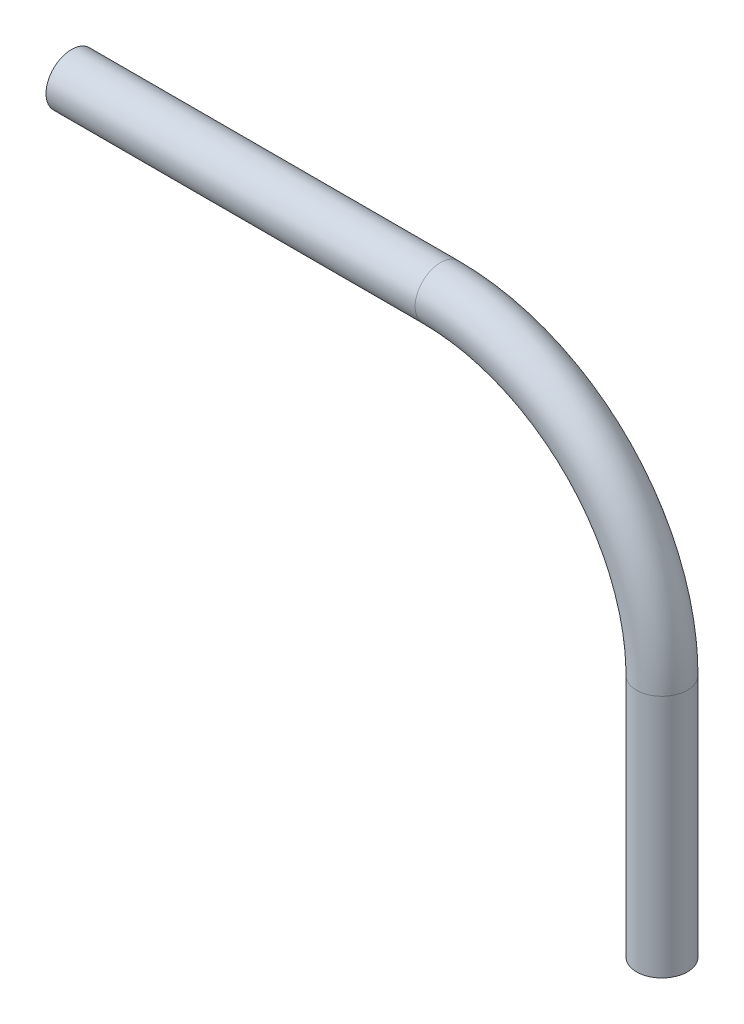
ISO-10303-21;
HEADER;
FILE_DESCRIPTION(('STEP AP214'),'2;1');
FILE_NAME('part.step','',(''),(''),'','','');
FILE_SCHEMA(('AUTOMOTIVE_DESIGN { 1 0 10303 214 1 1 1 1 }'));
ENDSEC;
DATA;
#1=APPLICATION_CONTEXT('core data for automotive mechanical design processes');
#2=APPLICATION_PROTOCOL_DEFINITION('international standard','automotive_design',2000,#1);
#3=PRODUCT_CONTEXT('',#1,'mechanical');
#4=PRODUCT('Part','Part','',(#3));
#5=PRODUCT_RELATED_PRODUCT_CATEGORY('part','',(#4));
#6=PRODUCT_DEFINITION_FORMATION('','',#4);
#7=PRODUCT_DEFINITION_CONTEXT('part definition',#1,'design');
#8=PRODUCT_DEFINITION('design','',#6,#7);
#9=PRODUCT_DEFINITION_SHAPE('','',#8);
#10=(LENGTH_UNIT() NAMED_UNIT(*) SI_UNIT(.MILLI.,.METRE.));
#11=(NAMED_UNIT(*) PLANE_ANGLE_UNIT() SI_UNIT($,.RADIAN.));
#12=(NAMED_UNIT(*) SI_UNIT($,.STERADIAN.) SOLID_ANGLE_UNIT());
#13=UNCERTAINTY_MEASURE_WITH_UNIT(LENGTH_MEASURE(1.E-05),#10,'distance_accuracy_value','');
#14=(GEOMETRIC_REPRESENTATION_CONTEXT(3) GLOBAL_UNCERTAINTY_ASSIGNED_CONTEXT((#13)) GLOBAL_UNIT_ASSIGNED_CONTEXT((#10,
#11,#12)) REPRESENTATION_CONTEXT('',''));
#15=CARTESIAN_POINT('',(0.,0.,0.));
#16=DIRECTION('',(0.,0.,1.));
#17=DIRECTION('',(1.,0.,0.));
#18=AXIS2_PLACEMENT_3D('',#15,#16,#17);
#19=CARTESIAN_POINT('',(6.10622663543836E-13,296.002867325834,0.));
#20=DIRECTION('',(0.,-1.,0.));
#21=DIRECTION('',(1.,0.,0.));
#22=AXIS2_PLACEMENT_3D('',#19,#20,#21);
#23=CYLINDRICAL_SURFACE('',#22,14.5);
#24=CARTESIAN_POINT('',(3.88578058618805E-13,296.002867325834,0.));
#25=DIRECTION('',(0.,-1.,0.));
#26=DIRECTION('',(1.,0.,0.));
#27=AXIS2_PLACEMENT_3D('',#24,#25,#26);
#28=CIRCLE('',#27,14.5);
#29=CARTESIAN_POINT('',(14.5000000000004,296.002867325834,0.));
#30=VERTEX_POINT('',#29);
#31=EDGE_CURVE('E38',#30,#30,#28,.F.);
#32=ORIENTED_EDGE('',*,*,#31,.T.);
#33=EDGE_LOOP('',(#32));
#34=FACE_BOUND('',#33,.T.);
#35=CARTESIAN_POINT('',(0.,130.749822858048,0.));
#36=DIRECTION('',(0.,-1.,0.));
#37=DIRECTION('',(1.,0.,0.));
#38=AXIS2_PLACEMENT_3D('',#35,#36,#37);
#39=CIRCLE('',#38,14.5);
#40=CARTESIAN_POINT('',(14.5,130.749822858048,0.));
#41=VERTEX_POINT('',#40);
#42=EDGE_CURVE('E18',#41,#41,#39,.F.);
#43=ORIENTED_EDGE('',*,*,#42,.F.);
#44=EDGE_LOOP('',(#43));
#45=FACE_BOUND('',#44,.T.);
#46=ADVANCED_FACE('F15',(#34,#45),#23,.F.);
#47=CARTESIAN_POINT('',(0.,130.749822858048,0.));
#48=DIRECTION('',(0.,-1.,0.));
#49=DIRECTION('',(1.,0.,0.));
#50=AXIS2_PLACEMENT_3D('',#47,#48,#49);
#51=PLANE('',#50);
#52=CARTESIAN_POINT('',(0.,130.749822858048,0.));
#53=DIRECTION('',(0.,-1.,0.));
#54=DIRECTION('',(1.,0.,0.));
#55=AXIS2_PLACEMENT_3D('',#52,#53,#54);
#56=CIRCLE('',#55,17.25);
#57=CARTESIAN_POINT('',(17.25,130.749822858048,0.));
#58=VERTEX_POINT('',#57);
#59=EDGE_CURVE('E35',#58,#58,#56,.F.);
#60=ORIENTED_EDGE('',*,*,#59,.F.);
#61=EDGE_LOOP('',(#60));
#62=FACE_BOUND('',#61,.T.);
#63=ORIENTED_EDGE('',*,*,#42,.T.);
#64=EDGE_LOOP('',(#63));
#65=FACE_BOUND('',#64,.T.);
#66=ADVANCED_FACE('F56',(#62,#65),#51,.T.);
#67=CARTESIAN_POINT('',(-149.999999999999,296.002867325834,0.));
#68=DIRECTION('',(0.,0.,-1.));
#69=DIRECTION('',(-1.,0.,0.));
#70=AXIS2_PLACEMENT_3D('',#67,#68,#69);
#71=TOROIDAL_SURFACE('',#70,149.999999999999,14.5);
#72=CARTESIAN_POINT('',(-149.999999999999,446.002867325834,0.));
#73=DIRECTION('',(1.,0.,0.));
#74=DIRECTION('',(0.,1.,0.));
#75=AXIS2_PLACEMENT_3D('',#72,#73,#74);
#76=CIRCLE('',#75,14.5);
#77=CARTESIAN_POINT('',(-149.999999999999,460.502867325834,0.));
#78=VERTEX_POINT('',#77);
#79=EDGE_CURVE('E37',#78,#78,#76,.F.);
#80=ORIENTED_EDGE('',*,*,#79,.T.);
#81=EDGE_LOOP('',(#80));
#82=FACE_BOUND('',#81,.T.);
#83=ORIENTED_EDGE('',*,*,#31,.F.);
#84=EDGE_LOOP('',(#83));
#85=FACE_BOUND('',#84,.T.);
#86=ADVANCED_FACE('F52',(#82,#85),#71,.F.);
#87=CARTESIAN_POINT('',(6.10622663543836E-13,296.002867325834,0.));
#88=DIRECTION('',(0.,-1.,0.));
#89=DIRECTION('',(1.,0.,0.));
#90=AXIS2_PLACEMENT_3D('',#87,#88,#89);
#91=CYLINDRICAL_SURFACE('',#90,17.25);
#92=CARTESIAN_POINT('',(3.88578058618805E-13,296.002867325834,0.));
#93=DIRECTION('',(0.,-1.,0.));
#94=DIRECTION('',(1.,0.,0.));
#95=AXIS2_PLACEMENT_3D('',#92,#93,#94);
#96=CIRCLE('',#95,17.25);
#97=CARTESIAN_POINT('',(17.2500000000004,296.002867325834,0.));
#98=VERTEX_POINT('',#97);
#99=EDGE_CURVE('E34',#98,#98,#96,.F.);
#100=ORIENTED_EDGE('',*,*,#99,.F.);
#101=EDGE_LOOP('',(#100));
#102=FACE_BOUND('',#101,.T.);
#103=ORIENTED_EDGE('',*,*,#59,.T.);
#104=EDGE_LOOP('',(#103));
#105=FACE_BOUND('',#104,.T.);
#106=ADVANCED_FACE('F55',(#102,#105),#91,.T.);
#107=CARTESIAN_POINT('',(-399.992266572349,446.002867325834,0.));
#108=DIRECTION('',(1.,0.,0.));
#109=DIRECTION('',(0.,1.,0.));
#110=AXIS2_PLACEMENT_3D('',#107,#108,#109);
#111=CYLINDRICAL_SURFACE('',#110,14.5);
#112=CARTESIAN_POINT('',(-399.992266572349,446.002867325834,0.));
#113=DIRECTION('',(1.,0.,0.));
#114=DIRECTION('',(0.,1.,0.));
#115=AXIS2_PLACEMENT_3D('',#112,#113,#114);
#116=CIRCLE('',#115,14.5);
#117=CARTESIAN_POINT('',(-399.992266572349,460.502867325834,0.));
#118=VERTEX_POINT('',#117);
#119=EDGE_CURVE('E27',#118,#118,#116,.F.);
#120=ORIENTED_EDGE('',*,*,#119,.T.);
#121=EDGE_LOOP('',(#120));
#122=FACE_BOUND('',#121,.T.);
#123=ORIENTED_EDGE('',*,*,#79,.F.);
#124=EDGE_LOOP('',(#123));
#125=FACE_BOUND('',#124,.T.);
#126=ADVANCED_FACE('F80',(#122,#125),#111,.F.);
#127=CARTESIAN_POINT('',(-149.999999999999,296.002867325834,0.));
#128=DIRECTION('',(0.,0.,-1.));
#129=DIRECTION('',(-1.,0.,0.));
#130=AXIS2_PLACEMENT_3D('',#127,#128,#129);
#131=TOROIDAL_SURFACE('',#130,149.999999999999,17.25);
#132=CARTESIAN_POINT('',(-149.999999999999,446.002867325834,0.));
#133=DIRECTION('',(1.,0.,0.));
#134=DIRECTION('',(0.,1.,0.));
#135=AXIS2_PLACEMENT_3D('',#132,#133,#134);
#136=CIRCLE('',#135,17.25);
#137=CARTESIAN_POINT('',(-149.999999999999,463.252867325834,0.));
#138=VERTEX_POINT('',#137);
#139=EDGE_CURVE('E22',#138,#138,#136,.F.);
#140=ORIENTED_EDGE('',*,*,#139,.F.);
#141=EDGE_LOOP('',(#140));
#142=FACE_BOUND('',#141,.T.);
#143=ORIENTED_EDGE('',*,*,#99,.T.);
#144=EDGE_LOOP('',(#143));
#145=FACE_BOUND('',#144,.T.);
#146=ADVANCED_FACE('F73',(#142,#145),#131,.T.);
#147=CARTESIAN_POINT('',(-399.992266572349,446.002867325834,0.));
#148=DIRECTION('',(1.,0.,0.));
#149=DIRECTION('',(0.,0.,-1.));
#150=AXIS2_PLACEMENT_3D('',#147,#148,#149);
#151=PLANE('',#150);
#152=CARTESIAN_POINT('',(-399.992266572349,446.002867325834,0.));
#153=DIRECTION('',(1.,0.,0.));
#154=DIRECTION('',(0.,1.,0.));
#155=AXIS2_PLACEMENT_3D('',#152,#153,#154);
#156=CIRCLE('',#155,17.25);
#157=CARTESIAN_POINT('',(-399.992266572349,463.252867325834,0.));
#158=VERTEX_POINT('',#157);
#159=EDGE_CURVE('E10',#158,#158,#156,.T.);
#160=ORIENTED_EDGE('',*,*,#159,.F.);
#161=EDGE_LOOP('',(#160));
#162=FACE_BOUND('',#161,.T.);
#163=ORIENTED_EDGE('',*,*,#119,.F.);
#164=EDGE_LOOP('',(#163));
#165=FACE_BOUND('',#164,.T.);
#166=ADVANCED_FACE('F68',(#162,#165),#151,.F.);
#167=CARTESIAN_POINT('',(-399.992266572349,446.002867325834,0.));
#168=DIRECTION('',(1.,0.,0.));
#169=DIRECTION('',(0.,1.,0.));
#170=AXIS2_PLACEMENT_3D('',#167,#168,#169);
#171=CYLINDRICAL_SURFACE('',#170,17.25);
#172=ORIENTED_EDGE('',*,*,#159,.T.);
#173=EDGE_LOOP('',(#172));
#174=FACE_BOUND('',#173,.T.);
#175=ORIENTED_EDGE('',*,*,#139,.T.);
#176=EDGE_LOOP('',(#175));
#177=FACE_BOUND('',#176,.T.);
#178=ADVANCED_FACE('F66',(#174,#177),#171,.T.);
#179=CLOSED_SHELL('',(#46,#66,#86,#106,#126,#146,#166,#178));
#180=MANIFOLD_SOLID_BREP('B1',#179);
#181=ADVANCED_BREP_SHAPE_REPRESENTATION('',(#18,#180),#14);
#182=SHAPE_DEFINITION_REPRESENTATION(#9,#181);
ENDSEC;
END-ISO-10303-21;
